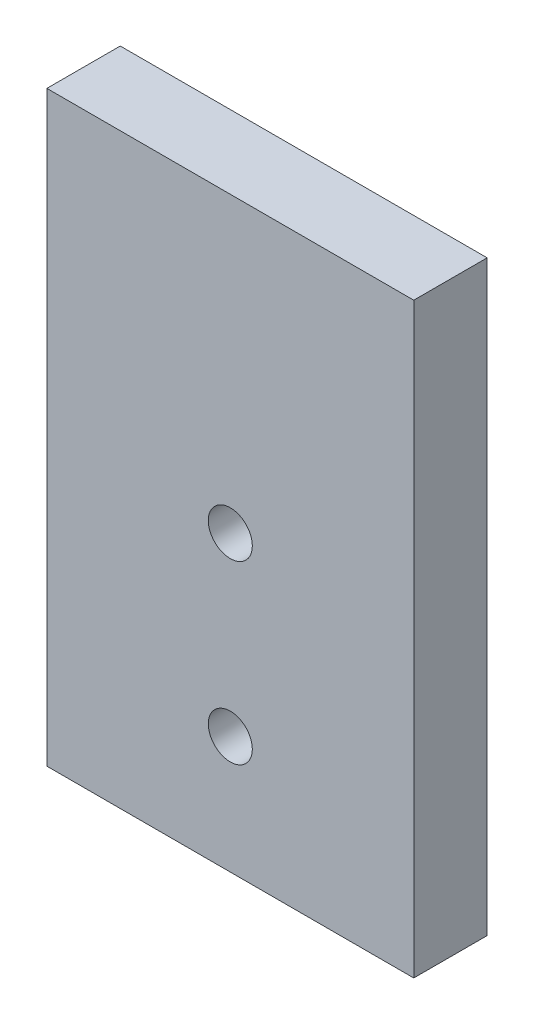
ISO-10303-21;
HEADER;
FILE_DESCRIPTION(('STEP AP214'),'2;1');
FILE_NAME('part.step','',(''),(''),'','','');
FILE_SCHEMA(('AUTOMOTIVE_DESIGN { 1 0 10303 214 1 1 1 1 }'));
ENDSEC;
DATA;
#1=APPLICATION_CONTEXT('core data for automotive mechanical design processes');
#2=APPLICATION_PROTOCOL_DEFINITION('international standard','automotive_design',2000,#1);
#3=PRODUCT_CONTEXT('',#1,'mechanical');
#4=PRODUCT('Part','Part','',(#3));
#5=PRODUCT_RELATED_PRODUCT_CATEGORY('part','',(#4));
#6=PRODUCT_DEFINITION_FORMATION('','',#4);
#7=PRODUCT_DEFINITION_CONTEXT('part definition',#1,'design');
#8=PRODUCT_DEFINITION('design','',#6,#7);
#9=PRODUCT_DEFINITION_SHAPE('','',#8);
#10=(LENGTH_UNIT() NAMED_UNIT(*) SI_UNIT(.MILLI.,.METRE.));
#11=(NAMED_UNIT(*) PLANE_ANGLE_UNIT() SI_UNIT($,.RADIAN.));
#12=(NAMED_UNIT(*) SI_UNIT($,.STERADIAN.) SOLID_ANGLE_UNIT());
#13=UNCERTAINTY_MEASURE_WITH_UNIT(LENGTH_MEASURE(1.E-05),#10,'distance_accuracy_value','');
#14=(GEOMETRIC_REPRESENTATION_CONTEXT(3) GLOBAL_UNCERTAINTY_ASSIGNED_CONTEXT((#13)) GLOBAL_UNIT_ASSIGNED_CONTEXT((#10,
#11,#12)) REPRESENTATION_CONTEXT('',''));
#15=CARTESIAN_POINT('',(0.,0.,0.));
#16=DIRECTION('',(0.,0.,1.));
#17=DIRECTION('',(1.,0.,0.));
#18=AXIS2_PLACEMENT_3D('',#15,#16,#17);
#19=CARTESIAN_POINT('',(0.,0.,10.));
#20=DIRECTION('',(1.,0.,0.));
#21=DIRECTION('',(0.,0.,-1.));
#22=AXIS2_PLACEMENT_3D('',#19,#20,#21);
#23=PLANE('',#22);
#24=DIRECTION('',(0.,-1.,0.));
#25=VECTOR('',#24,1.);
#26=CARTESIAN_POINT('',(0.,0.,0.));
#27=LINE('',#26,#25);
#28=CARTESIAN_POINT('',(0.,80.,0.));
#29=VERTEX_POINT('',#28);
#30=CARTESIAN_POINT('',(0.,0.,0.));
#31=VERTEX_POINT('',#30);
#32=EDGE_CURVE('E96',#29,#31,#27,.T.);
#33=ORIENTED_EDGE('',*,*,#32,.T.);
#34=DIRECTION('',(0.,0.,-1.));
#35=VECTOR('',#34,1.);
#36=CARTESIAN_POINT('',(0.,0.,10.));
#37=LINE('',#36,#35);
#38=CARTESIAN_POINT('',(0.,0.,10.));
#39=VERTEX_POINT('',#38);
#40=EDGE_CURVE('E11',#39,#31,#37,.T.);
#41=ORIENTED_EDGE('',*,*,#40,.F.);
#42=DIRECTION('',(0.,-1.,0.));
#43=VECTOR('',#42,1.);
#44=CARTESIAN_POINT('',(0.,0.,10.));
#45=LINE('',#44,#43);
#46=CARTESIAN_POINT('',(0.,80.,10.));
#47=VERTEX_POINT('',#46);
#48=EDGE_CURVE('E84',#47,#39,#45,.T.);
#49=ORIENTED_EDGE('',*,*,#48,.F.);
#50=DIRECTION('',(0.,0.,-1.));
#51=VECTOR('',#50,1.);
#52=CARTESIAN_POINT('',(0.,80.,10.));
#53=LINE('',#52,#51);
#54=EDGE_CURVE('E92',#47,#29,#53,.T.);
#55=ORIENTED_EDGE('',*,*,#54,.T.);
#56=EDGE_LOOP('',(#33,#41,#49,#55));
#57=FACE_BOUND('',#56,.T.);
#58=ADVANCED_FACE('F33',(#57),#23,.F.);
#59=CARTESIAN_POINT('',(0.,0.,10.));
#60=DIRECTION('',(0.,1.,0.));
#61=DIRECTION('',(0.,0.,1.));
#62=AXIS2_PLACEMENT_3D('',#59,#60,#61);
#63=PLANE('',#62);
#64=DIRECTION('',(1.,0.,0.));
#65=VECTOR('',#64,1.);
#66=CARTESIAN_POINT('',(0.,0.,0.));
#67=LINE('',#66,#65);
#68=CARTESIAN_POINT('',(50.,0.,0.));
#69=VERTEX_POINT('',#68);
#70=EDGE_CURVE('E88',#31,#69,#67,.T.);
#71=ORIENTED_EDGE('',*,*,#70,.T.);
#72=DIRECTION('',(0.,0.,-1.));
#73=VECTOR('',#72,1.);
#74=CARTESIAN_POINT('',(50.,0.,10.));
#75=LINE('',#74,#73);
#76=CARTESIAN_POINT('',(50.,0.,10.));
#77=VERTEX_POINT('',#76);
#78=EDGE_CURVE('E41',#77,#69,#75,.T.);
#79=ORIENTED_EDGE('',*,*,#78,.F.);
#80=DIRECTION('',(1.,0.,0.));
#81=VECTOR('',#80,1.);
#82=CARTESIAN_POINT('',(0.,0.,10.));
#83=LINE('',#82,#81);
#84=EDGE_CURVE('E79',#39,#77,#83,.T.);
#85=ORIENTED_EDGE('',*,*,#84,.F.);
#86=ORIENTED_EDGE('',*,*,#40,.T.);
#87=EDGE_LOOP('',(#71,#79,#85,#86));
#88=FACE_BOUND('',#87,.T.);
#89=ADVANCED_FACE('F87',(#88),#63,.F.);
#90=CARTESIAN_POINT('',(50.,0.,10.));
#91=DIRECTION('',(-1.,0.,0.));
#92=DIRECTION('',(0.,0.,1.));
#93=AXIS2_PLACEMENT_3D('',#90,#91,#92);
#94=PLANE('',#93);
#95=DIRECTION('',(0.,1.,0.));
#96=VECTOR('',#95,1.);
#97=CARTESIAN_POINT('',(50.,0.,0.));
#98=LINE('',#97,#96);
#99=CARTESIAN_POINT('',(50.,80.,0.));
#100=VERTEX_POINT('',#99);
#101=EDGE_CURVE('E66',#69,#100,#98,.T.);
#102=ORIENTED_EDGE('',*,*,#101,.T.);
#103=DIRECTION('',(0.,0.,-1.));
#104=VECTOR('',#103,1.);
#105=CARTESIAN_POINT('',(50.,80.,10.));
#106=LINE('',#105,#104);
#107=CARTESIAN_POINT('',(50.,80.,10.));
#108=VERTEX_POINT('',#107);
#109=EDGE_CURVE('E89',#108,#100,#106,.T.);
#110=ORIENTED_EDGE('',*,*,#109,.F.);
#111=DIRECTION('',(0.,1.,0.));
#112=VECTOR('',#111,1.);
#113=CARTESIAN_POINT('',(50.,0.,10.));
#114=LINE('',#113,#112);
#115=EDGE_CURVE('E82',#77,#108,#114,.T.);
#116=ORIENTED_EDGE('',*,*,#115,.F.);
#117=ORIENTED_EDGE('',*,*,#78,.T.);
#118=EDGE_LOOP('',(#102,#110,#116,#117));
#119=FACE_BOUND('',#118,.T.);
#120=ADVANCED_FACE('F90',(#119),#94,.F.);
#121=CARTESIAN_POINT('',(0.,80.,10.));
#122=DIRECTION('',(0.,-1.,0.));
#123=DIRECTION('',(0.,0.,-1.));
#124=AXIS2_PLACEMENT_3D('',#121,#122,#123);
#125=PLANE('',#124);
#126=DIRECTION('',(-1.,0.,0.));
#127=VECTOR('',#126,1.);
#128=CARTESIAN_POINT('',(0.,80.,0.));
#129=LINE('',#128,#127);
#130=EDGE_CURVE('E72',#100,#29,#129,.T.);
#131=ORIENTED_EDGE('',*,*,#130,.T.);
#132=ORIENTED_EDGE('',*,*,#54,.F.);
#133=DIRECTION('',(-1.,0.,0.));
#134=VECTOR('',#133,1.);
#135=CARTESIAN_POINT('',(0.,80.,10.));
#136=LINE('',#135,#134);
#137=EDGE_CURVE('E49',#108,#47,#136,.T.);
#138=ORIENTED_EDGE('',*,*,#137,.F.);
#139=ORIENTED_EDGE('',*,*,#109,.T.);
#140=EDGE_LOOP('',(#131,#132,#138,#139));
#141=FACE_BOUND('',#140,.T.);
#142=ADVANCED_FACE('F104',(#141),#125,.F.);
#143=CARTESIAN_POINT('',(0.,0.,10.));
#144=DIRECTION('',(0.,0.,-1.));
#145=DIRECTION('',(-1.,0.,0.));
#146=AXIS2_PLACEMENT_3D('',#143,#144,#145);
#147=PLANE('',#146);
#148=CARTESIAN_POINT('',(25.,40.,10.));
#149=DIRECTION('',(0.,0.,1.));
#150=DIRECTION('',(1.,0.,0.));
#151=AXIS2_PLACEMENT_3D('',#148,#149,#150);
#152=CIRCLE('',#151,3.);
#153=CARTESIAN_POINT('',(28.,40.,10.));
#154=VERTEX_POINT('',#153);
#155=EDGE_CURVE('E116',#154,#154,#152,.T.);
#156=ORIENTED_EDGE('',*,*,#155,.F.);
#157=EDGE_LOOP('',(#156));
#158=FACE_BOUND('',#157,.T.);
#159=CARTESIAN_POINT('',(25.,16.,10.));
#160=DIRECTION('',(0.,0.,1.));
#161=DIRECTION('',(1.,0.,0.));
#162=AXIS2_PLACEMENT_3D('',#159,#160,#161);
#163=CIRCLE('',#162,3.);
#164=CARTESIAN_POINT('',(28.,16.,10.));
#165=VERTEX_POINT('',#164);
#166=EDGE_CURVE('E110',#165,#165,#163,.T.);
#167=ORIENTED_EDGE('',*,*,#166,.F.);
#168=EDGE_LOOP('',(#167));
#169=FACE_BOUND('',#168,.T.);
#170=ORIENTED_EDGE('',*,*,#48,.T.);
#171=ORIENTED_EDGE('',*,*,#84,.T.);
#172=ORIENTED_EDGE('',*,*,#115,.T.);
#173=ORIENTED_EDGE('',*,*,#137,.T.);
#174=EDGE_LOOP('',(#170,#171,#172,#173));
#175=FACE_BOUND('',#174,.T.);
#176=ADVANCED_FACE('F80',(#158,#169,#175),#147,.F.);
#177=CARTESIAN_POINT('',(0.,0.,0.));
#178=DIRECTION('',(0.,0.,-1.));
#179=DIRECTION('',(-1.,0.,0.));
#180=AXIS2_PLACEMENT_3D('',#177,#178,#179);
#181=PLANE('',#180);
#182=CARTESIAN_POINT('',(25.,40.,0.));
#183=DIRECTION('',(0.,0.,1.));
#184=DIRECTION('',(1.,0.,0.));
#185=AXIS2_PLACEMENT_3D('',#182,#183,#184);
#186=CIRCLE('',#185,3.);
#187=CARTESIAN_POINT('',(28.,40.,0.));
#188=VERTEX_POINT('',#187);
#189=EDGE_CURVE('E113',#188,#188,#186,.T.);
#190=ORIENTED_EDGE('',*,*,#189,.T.);
#191=EDGE_LOOP('',(#190));
#192=FACE_BOUND('',#191,.T.);
#193=CARTESIAN_POINT('',(25.,16.,0.));
#194=DIRECTION('',(0.,0.,1.));
#195=DIRECTION('',(1.,0.,0.));
#196=AXIS2_PLACEMENT_3D('',#193,#194,#195);
#197=CIRCLE('',#196,3.);
#198=CARTESIAN_POINT('',(28.,16.,0.));
#199=VERTEX_POINT('',#198);
#200=EDGE_CURVE('E99',#199,#199,#197,.T.);
#201=ORIENTED_EDGE('',*,*,#200,.T.);
#202=EDGE_LOOP('',(#201));
#203=FACE_BOUND('',#202,.T.);
#204=ORIENTED_EDGE('',*,*,#32,.F.);
#205=ORIENTED_EDGE('',*,*,#130,.F.);
#206=ORIENTED_EDGE('',*,*,#101,.F.);
#207=ORIENTED_EDGE('',*,*,#70,.F.);
#208=EDGE_LOOP('',(#204,#205,#206,#207));
#209=FACE_BOUND('',#208,.T.);
#210=ADVANCED_FACE('F107',(#192,#203,#209),#181,.T.);
#211=CARTESIAN_POINT('',(25.,16.,0.));
#212=DIRECTION('',(0.,0.,1.));
#213=DIRECTION('',(1.,0.,0.));
#214=AXIS2_PLACEMENT_3D('',#211,#212,#213);
#215=CYLINDRICAL_SURFACE('',#214,3.);
#216=ORIENTED_EDGE('',*,*,#200,.F.);
#217=EDGE_LOOP('',(#216));
#218=FACE_BOUND('',#217,.T.);
#219=ORIENTED_EDGE('',*,*,#166,.T.);
#220=EDGE_LOOP('',(#219));
#221=FACE_BOUND('',#220,.T.);
#222=ADVANCED_FACE('F127',(#218,#221),#215,.F.);
#223=CARTESIAN_POINT('',(25.,40.,0.));
#224=DIRECTION('',(0.,0.,1.));
#225=DIRECTION('',(1.,0.,0.));
#226=AXIS2_PLACEMENT_3D('',#223,#224,#225);
#227=CYLINDRICAL_SURFACE('',#226,3.);
#228=ORIENTED_EDGE('',*,*,#189,.F.);
#229=EDGE_LOOP('',(#228));
#230=FACE_BOUND('',#229,.T.);
#231=ORIENTED_EDGE('',*,*,#155,.T.);
#232=EDGE_LOOP('',(#231));
#233=FACE_BOUND('',#232,.T.);
#234=ADVANCED_FACE('F124',(#230,#233),#227,.F.);
#235=CLOSED_SHELL('',(#58,#89,#120,#142,#176,#210,#222,#234));
#236=MANIFOLD_SOLID_BREP('B2',#235);
#237=ADVANCED_BREP_SHAPE_REPRESENTATION('',(#18,#236),#14);
#238=SHAPE_DEFINITION_REPRESENTATION(#9,#237);
ENDSEC;
END-ISO-10303-21;
